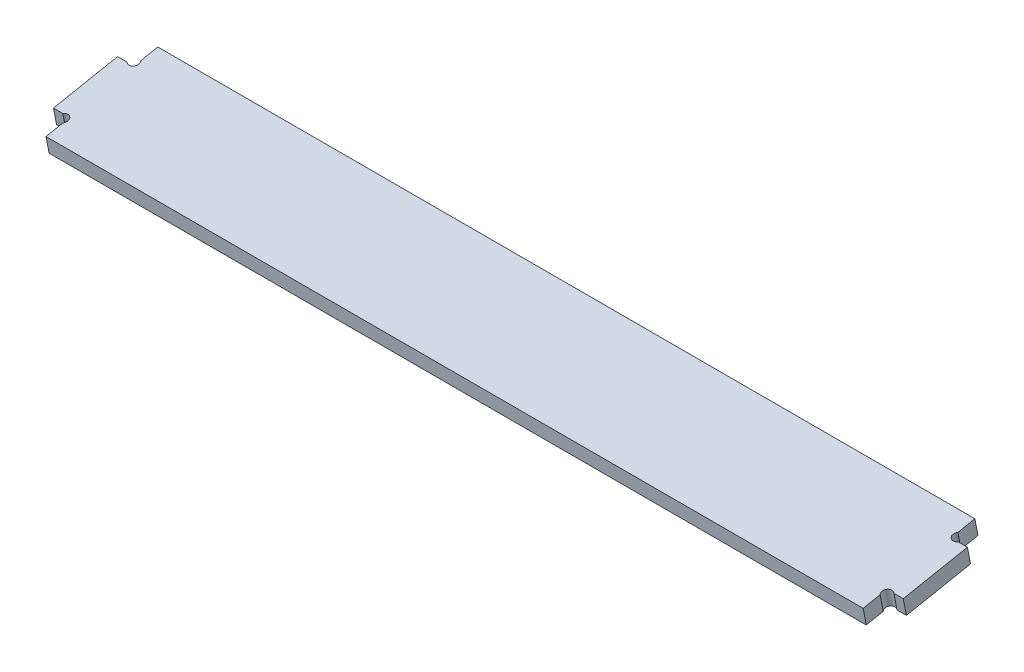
from build123d import *

# Parameters (mm, degrees)
SALIENTE_EXTRUIR2_DEPTH = 500
CROQUIS4_W              = 10
CROQUIS4_H              = 40
SALIENTE_EXTRUIR3_DEPTH = 10
CROQUIS5_R              = 3
CORTAR_EXTRUIR1_DEPTH   = 540.355223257


with BuildPart() as part:
    # Croquis3 → Saliente-Extruir2 (new body)
    with BuildSketch(Plane(origin=(-500, 0, 0), x_dir=(0, 0, -1), z_dir=(1, 0, 0))):
        Polygon((10, 494.152803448), (78.383825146, 507.426846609), (76.478284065, 517.24361355), (8.094458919, 503.96957039), align=None)
    extrude(amount=SALIENTE_EXTRUIR2_DEPTH)

    # Croquis4 → Saliente-Extruir3 (add)
    with BuildSketch(Plane(origin=(0, 484.155827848, 93.979904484), x_dir=(1, 0, 0), z_dir=(0, 0.9816766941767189, 0.19055410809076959))):
        with Locations((-505, 138.809729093)):
            Rectangle(CROQUIS4_W, CROQUIS4_H)
    saliente_extruir3 = extrude(amount=-SALIENTE_EXTRUIR3_DEPTH)

    # Croquis5 → Cortar-Extruir1 (cut, symmetric)
    with BuildSketch(Plane(origin=(0, 484.155827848, 93.979904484), x_dir=(1, 0, 0), z_dir=(0, 0.9816766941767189, 0.19055410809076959))):
        with Locations((-502.121320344, 160.931049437)):
            Circle(CROQUIS5_R)
        with Locations((-502.121320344, 116.68840875)):
            Circle(CROQUIS5_R)
    cortar_extruir1 = extrude(amount=CORTAR_EXTRUIR1_DEPTH, both=True, mode=Mode.SUBTRACT)

    # Simetr_a1: Saliente-Extruir3, Cortar-Extruir1 across plane
    add(saliente_extruir3.mirror(Plane.ZY.offset(250)))
    add(cortar_extruir1.mirror(Plane.ZY.offset(250)), mode=Mode.SUBTRACT)


solid = part.part
